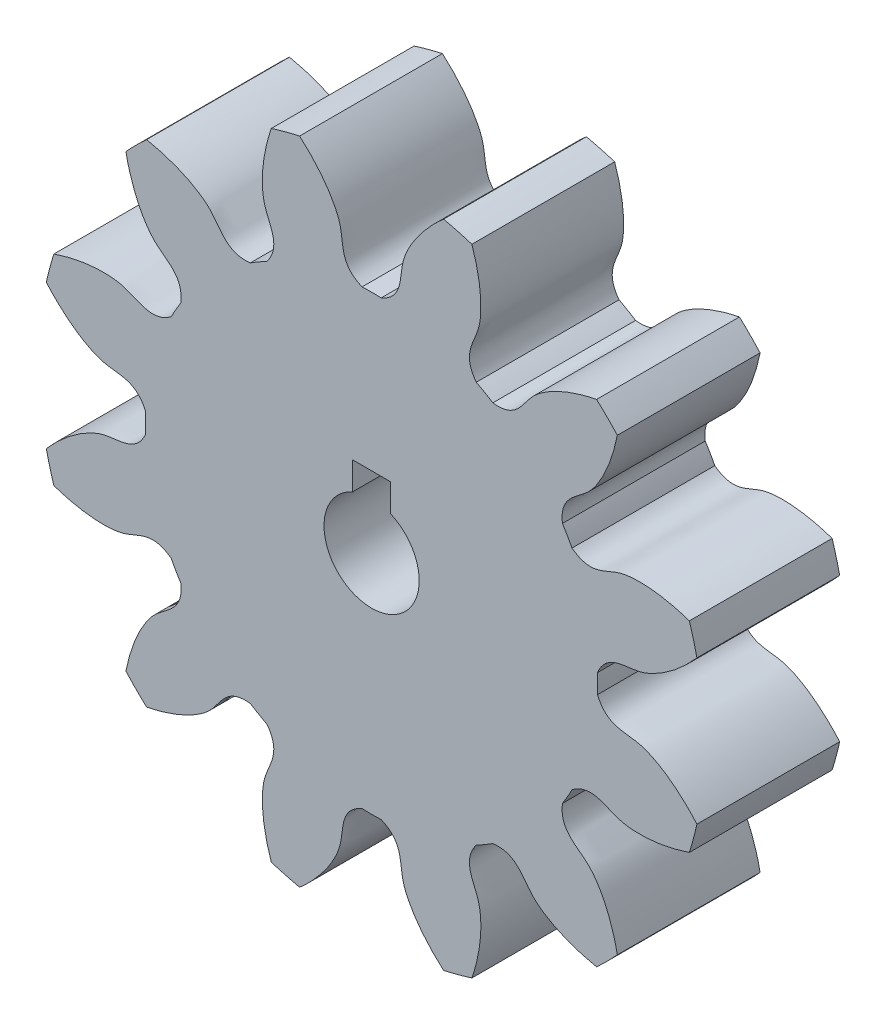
from build123d import *

# Parameters (mm, degrees)
SKETCH_1_R               = 14
EXTRUDE_1_DEPTH          = 6
CUT_EXTRUDE_1_DEPTH      = 21.688160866
PATTERN_CIRCULAR_1_COUNT = 12
CUT_EXTRUDE_2_DEPTH      = 10


with BuildPart() as part:
    # Sketch 1 → Extrude 1 (new body)
    with BuildSketch(Plane.XY):
        Circle(SKETCH_1_R)
    extrude(amount=EXTRUDE_1_DEPTH)

    # Sketch 2 → Cut-Extrude 1 (cut, through all)
    with BuildSketch(Plane.XY):
        with BuildLine():
            ThreePointArc((0.401680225, 9.491504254), (0, 9.5), (-0.401680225, 9.491504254))
            add(Edge.make_bspline(
                [(-0.401680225, 9.491504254), (-1.361577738, 9.898614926), (-1.148746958, 10.689637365), (-1.352304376, 11.378961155), (-1.365247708, 11.419811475), (-1.380454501, 11.46466685), (-1.398085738, 11.513452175), (-1.41830525, 11.566086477), (-1.441273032, 11.622484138), (-1.467147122, 11.682554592), (-1.496082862, 11.746202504), (-1.528232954, 11.813327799), (-1.563747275, 11.883825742), (-1.602772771, 11.957587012), (-1.645453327, 12.034497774), (-1.691929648, 12.114439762), (-1.742339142, 12.197290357), (-1.796815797, 12.282922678), (-1.855490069, 12.371205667), (-1.918488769, 12.462004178), (-1.985934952, 12.555179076), (-2.057947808, 12.650587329), (-2.134642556, 12.748082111), (-2.216130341, 12.847512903), (-2.302518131, 12.948725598), (-2.39390862, 13.051562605), (-2.490400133, 13.155862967), (-2.59208653, 13.261462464), (-2.699057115, 13.368193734), (-2.811396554, 13.475886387), (-2.929184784, 13.584367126), (-3.052496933, 13.693459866), (-3.181403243, 13.802985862), (-3.31596899, 13.912763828), (-3.456254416, 14.02261007), (-3.602314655, 14.132338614), (-3.754199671, 14.241761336), (-3.911954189, 14.350688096), (-4.07561764, 14.458926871), (-4.2452241, 14.566283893), (-4.420802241, 14.672563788), (-4.602375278, 14.77756971), (-4.789960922, 14.881103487), (-4.983571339, 14.98296576), (-5.183213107, 15.082956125), (-5.388887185, 15.18087328), (-5.600588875, 15.276515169), (-5.818307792, 15.369679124), (-6.042027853, 15.460162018), (-6.27172721, 15.547760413), (-6.588759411, 15.661455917), (-6.8311872, 15.740202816), (-6.995210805, 15.78994182)],
                knots=[0, 0, 0, 0, 0.218015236, 0.222043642, 0.226545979, 0.231522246, 0.236972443, 0.24289657, 0.249294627, 0.256166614, 0.263512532, 0.271332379, 0.279626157, 0.288393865, 0.297635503, 0.307351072, 0.31754057, 0.328203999, 0.339341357, 0.350952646, 0.363037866, 0.375597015, 0.388630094, 0.402137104, 0.416118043, 0.430572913, 0.445501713, 0.460904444, 0.476781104, 0.493131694, 0.509956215, 0.527254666, 0.545027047, 0.563273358, 0.581993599, 0.601187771, 0.620855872, 0.640997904, 0.661613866, 0.682703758, 0.704267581, 0.726305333, 0.748817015, 0.771802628, 0.795262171, 0.819195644, 0.843603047, 0.868484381, 0.893839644, 0.919668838, 0.945971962, 1, 1, 1, 1], degree=3))
            ThreePointArc((-6.995210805, 15.78994182), (0, 17.270067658), (6.995210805, 15.78994182))
            add(Edge.make_bspline(
                [(0.401680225, 9.491504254), (1.361577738, 9.898614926), (1.148746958, 10.689637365), (1.352304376, 11.378961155), (1.365247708, 11.419811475), (1.380454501, 11.46466685), (1.398085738, 11.513452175), (1.41830525, 11.566086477), (1.441273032, 11.622484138), (1.467147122, 11.682554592), (1.496082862, 11.746202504), (1.528232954, 11.813327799), (1.563747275, 11.883825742), (1.602772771, 11.957587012), (1.645453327, 12.034497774), (1.691929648, 12.114439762), (1.742339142, 12.197290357), (1.796815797, 12.282922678), (1.855490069, 12.371205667), (1.918488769, 12.462004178), (1.985934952, 12.555179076), (2.057947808, 12.650587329), (2.134642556, 12.748082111), (2.216130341, 12.847512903), (2.302518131, 12.948725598), (2.39390862, 13.051562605), (2.490400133, 13.155862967), (2.59208653, 13.261462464), (2.699057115, 13.368193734), (2.811396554, 13.475886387), (2.929184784, 13.584367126), (3.052496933, 13.693459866), (3.181403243, 13.802985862), (3.31596899, 13.912763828), (3.456254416, 14.02261007), (3.602314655, 14.132338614), (3.754199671, 14.241761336), (3.911954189, 14.350688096), (4.07561764, 14.458926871), (4.2452241, 14.566283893), (4.420802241, 14.672563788), (4.602375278, 14.77756971), (4.789960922, 14.881103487), (4.983571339, 14.98296576), (5.183213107, 15.082956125), (5.388887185, 15.18087328), (5.600588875, 15.276515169), (5.818307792, 15.369679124), (6.042027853, 15.460162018), (6.27172721, 15.547760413), (6.588759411, 15.661455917), (6.8311872, 15.740202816), (6.995210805, 15.78994182)],
                knots=[0, 0, 0, 0, 0.218015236, 0.222043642, 0.226545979, 0.231522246, 0.236972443, 0.24289657, 0.249294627, 0.256166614, 0.263512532, 0.271332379, 0.279626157, 0.288393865, 0.297635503, 0.307351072, 0.31754057, 0.328203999, 0.339341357, 0.350952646, 0.363037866, 0.375597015, 0.388630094, 0.402137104, 0.416118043, 0.430572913, 0.445501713, 0.460904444, 0.476781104, 0.493131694, 0.509956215, 0.527254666, 0.545027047, 0.563273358, 0.581993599, 0.601187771, 0.620855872, 0.640997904, 0.661613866, 0.682703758, 0.704267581, 0.726305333, 0.748817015, 0.771802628, 0.795262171, 0.819195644, 0.843603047, 0.868484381, 0.893839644, 0.919668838, 0.945971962, 1, 1, 1, 1], degree=3))
        make_face()
    cut_extrude_1 = extrude(amount=CUT_EXTRUDE_1_DEPTH, mode=Mode.SUBTRACT)

    # Pattern Circular 1: Cut-Extrude 1 ×12 about axis
    pattern_circular_1_axis = Axis((0, 0, 6), (0, 0, -1))
    for i in range(1, PATTERN_CIRCULAR_1_COUNT):
        add(cut_extrude_1.rotate(pattern_circular_1_axis, i * 360 / PATTERN_CIRCULAR_1_COUNT), mode=Mode.SUBTRACT)

    # Sketch 4 → Cut-Extrude 2 (cut)
    with BuildSketch(Plane.XY.offset(6)):
        with BuildLine():
            ThreePointArc((2, 0), (1.673320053, 1.095445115), (0.8, 1.833030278))
            Line((0.8, 1.833030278), (0.8, 1))
            Line((0.8, 1), (-0.8, 1))
            Line((-0.8, 1), (-0.8, 1.833030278))
            ThreePointArc((-0.8, 1.833030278), (-1.095445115, -1.673320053), (2, 0))
        make_face()
        with BuildLine():
            Line((0.8, 1), (0.8, 1.833030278))
            ThreePointArc((0.8, 1.833030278), (0, 2), (-0.8, 1.833030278))
            Line((-0.8, 1.833030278), (-0.8, 1))
            Line((-0.8, 1), (0.8, 1))
        make_face()
        with BuildLine():
            ThreePointArc((2, 0), (1.673320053, 1.095445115), (0.8, 1.833030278))
            Line((0.8, 1.833030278), (0.8, 1))
            Line((0.8, 1), (-0.8, 1))
            Line((-0.8, 1), (-0.8, 1.833030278))
            ThreePointArc((-0.8, 1.833030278), (-1.095445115, -1.673320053), (2, 0))
        make_face()
        with BuildLine():
            Line((0.8, 1), (0.8, 1.833030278))
            ThreePointArc((0.8, 1.833030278), (0, 2), (-0.8, 1.833030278))
            Line((-0.8, 1.833030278), (-0.8, 1))
            Line((-0.8, 1), (0.8, 1))
        make_face()
        with BuildLine():
            Line((0.8, 1.833030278), (0.8, 3))
            Line((0.8, 3), (-0.8, 3))
            Line((-0.8, 3), (-0.8, 1.833030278))
            ThreePointArc((-0.8, 1.833030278), (0, 2), (0.8, 1.833030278))
        make_face()
    extrude(amount=-CUT_EXTRUDE_2_DEPTH, mode=Mode.SUBTRACT)


solid = part.part
